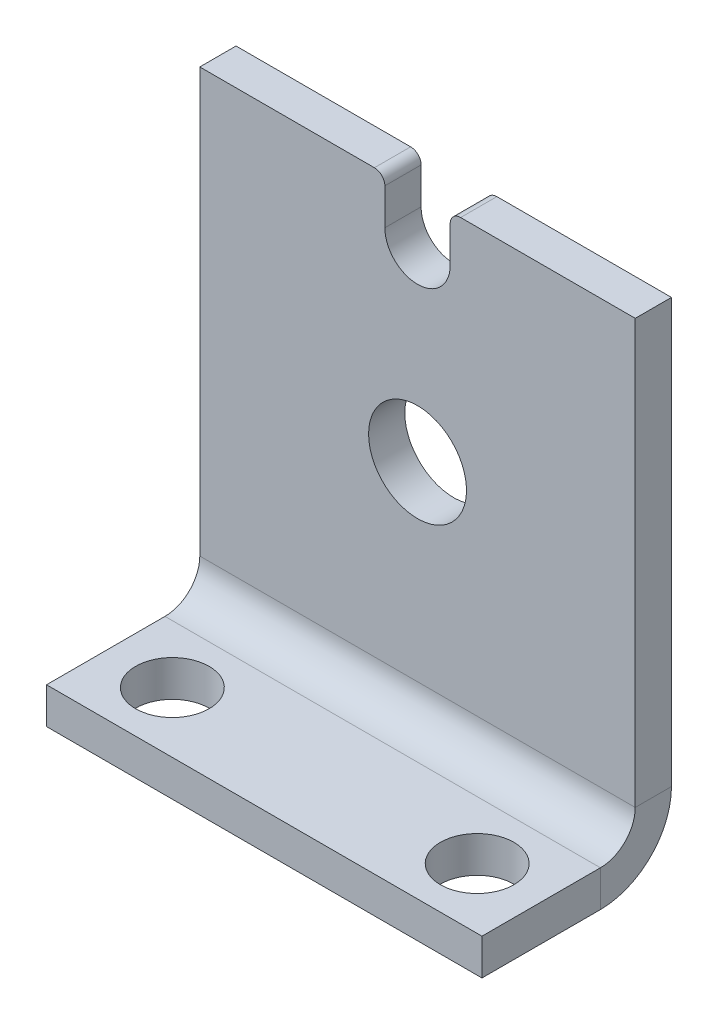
ISO-10303-21;
HEADER;
FILE_DESCRIPTION(('STEP AP214'),'2;1');
FILE_NAME('part.step','',(''),(''),'','','');
FILE_SCHEMA(('AUTOMOTIVE_DESIGN { 1 0 10303 214 1 1 1 1 }'));
ENDSEC;
DATA;
#1=APPLICATION_CONTEXT('core data for automotive mechanical design processes');
#2=APPLICATION_PROTOCOL_DEFINITION('international standard','automotive_design',2000,#1);
#3=PRODUCT_CONTEXT('',#1,'mechanical');
#4=PRODUCT('Part','Part','',(#3));
#5=PRODUCT_RELATED_PRODUCT_CATEGORY('part','',(#4));
#6=PRODUCT_DEFINITION_FORMATION('','',#4);
#7=PRODUCT_DEFINITION_CONTEXT('part definition',#1,'design');
#8=PRODUCT_DEFINITION('design','',#6,#7);
#9=PRODUCT_DEFINITION_SHAPE('','',#8);
#10=(LENGTH_UNIT() NAMED_UNIT(*) SI_UNIT(.MILLI.,.METRE.));
#11=(NAMED_UNIT(*) PLANE_ANGLE_UNIT() SI_UNIT($,.RADIAN.));
#12=(NAMED_UNIT(*) SI_UNIT($,.STERADIAN.) SOLID_ANGLE_UNIT());
#13=UNCERTAINTY_MEASURE_WITH_UNIT(LENGTH_MEASURE(1.E-05),#10,'distance_accuracy_value','');
#14=(GEOMETRIC_REPRESENTATION_CONTEXT(3) GLOBAL_UNCERTAINTY_ASSIGNED_CONTEXT((#13)) GLOBAL_UNIT_ASSIGNED_CONTEXT((#10,
#11,#12)) REPRESENTATION_CONTEXT('',''));
#15=CARTESIAN_POINT('',(0.,0.,0.));
#16=DIRECTION('',(0.,0.,1.));
#17=DIRECTION('',(1.,0.,0.));
#18=AXIS2_PLACEMENT_3D('',#15,#16,#17);
#19=CARTESIAN_POINT('',(-15.875,18.034,-2.6416));
#20=DIRECTION('',(0.,1.,0.));
#21=DIRECTION('',(0.,0.,1.));
#22=AXIS2_PLACEMENT_3D('',#19,#20,#21);
#23=PLANE('',#22);
#24=DIRECTION('',(-1.,0.,0.));
#25=VECTOR('',#24,1.);
#26=CARTESIAN_POINT('',(-15.875,18.034,0.));
#27=LINE('',#26,#25);
#28=CARTESIAN_POINT('',(-3.14325,18.034,0.));
#29=VERTEX_POINT('',#28);
#30=CARTESIAN_POINT('',(-15.875,18.034,0.));
#31=VERTEX_POINT('',#30);
#32=EDGE_CURVE('E273',#29,#31,#27,.T.);
#33=ORIENTED_EDGE('',*,*,#32,.F.);
#34=DIRECTION('',(0.,0.,1.));
#35=VECTOR('',#34,1.);
#36=CARTESIAN_POINT('',(-3.14325,18.034,-2.6416));
#37=LINE('',#36,#35);
#38=CARTESIAN_POINT('',(-3.14325,18.034,-2.6416));
#39=VERTEX_POINT('',#38);
#40=EDGE_CURVE('E289',#29,#39,#37,.F.);
#41=ORIENTED_EDGE('',*,*,#40,.T.);
#42=DIRECTION('',(-1.,0.,0.));
#43=VECTOR('',#42,1.);
#44=CARTESIAN_POINT('',(-15.875,18.034,-2.6416));
#45=LINE('',#44,#43);
#46=CARTESIAN_POINT('',(-15.875,18.034,-2.6416));
#47=VERTEX_POINT('',#46);
#48=EDGE_CURVE('E264',#39,#47,#45,.T.);
#49=ORIENTED_EDGE('',*,*,#48,.T.);
#50=DIRECTION('',(0.,0.,1.));
#51=VECTOR('',#50,1.);
#52=CARTESIAN_POINT('',(-15.875,18.034,-2.6416));
#53=LINE('',#52,#51);
#54=EDGE_CURVE('E278',#47,#31,#53,.T.);
#55=ORIENTED_EDGE('',*,*,#54,.T.);
#56=EDGE_LOOP('',(#33,#41,#49,#55));
#57=FACE_BOUND('',#56,.T.);
#58=ADVANCED_FACE('F56',(#57),#23,.T.);
#59=CARTESIAN_POINT('',(15.875,-18.034,-2.6416));
#60=DIRECTION('',(1.,0.,0.));
#61=DIRECTION('',(0.,0.,-1.));
#62=AXIS2_PLACEMENT_3D('',#59,#60,#61);
#63=PLANE('',#62);
#64=DIRECTION('',(0.,1.,0.));
#65=VECTOR('',#64,1.);
#66=CARTESIAN_POINT('',(15.875,-18.034,0.));
#67=LINE('',#66,#65);
#68=CARTESIAN_POINT('',(15.875,-12.8524,0.));
#69=VERTEX_POINT('',#68);
#70=CARTESIAN_POINT('',(15.875,18.034,0.));
#71=VERTEX_POINT('',#70);
#72=EDGE_CURVE('E259',#69,#71,#67,.T.);
#73=ORIENTED_EDGE('',*,*,#72,.F.);
#74=DIRECTION('',(0.,0.,-1.));
#75=VECTOR('',#74,1.);
#76=CARTESIAN_POINT('',(15.875,-12.8524,0.));
#77=LINE('',#76,#75);
#78=CARTESIAN_POINT('',(15.875,-12.8524,-2.6416));
#79=VERTEX_POINT('',#78);
#80=EDGE_CURVE('E246',#69,#79,#77,.T.);
#81=ORIENTED_EDGE('',*,*,#80,.T.);
#82=DIRECTION('',(0.,1.,0.));
#83=VECTOR('',#82,1.);
#84=CARTESIAN_POINT('',(15.875,-18.034,-2.6416));
#85=LINE('',#84,#83);
#86=CARTESIAN_POINT('',(15.875,18.034,-2.6416));
#87=VERTEX_POINT('',#86);
#88=EDGE_CURVE('E262',#79,#87,#85,.T.);
#89=ORIENTED_EDGE('',*,*,#88,.T.);
#90=DIRECTION('',(0.,0.,1.));
#91=VECTOR('',#90,1.);
#92=CARTESIAN_POINT('',(15.875,18.034,-2.6416));
#93=LINE('',#92,#91);
#94=EDGE_CURVE('E271',#87,#71,#93,.T.);
#95=ORIENTED_EDGE('',*,*,#94,.T.);
#96=EDGE_LOOP('',(#73,#81,#89,#95));
#97=FACE_BOUND('',#96,.T.);
#98=ADVANCED_FACE('F317',(#97),#63,.T.);
#99=CARTESIAN_POINT('',(0.,0.,-2.6416));
#100=DIRECTION('',(0.,0.,-1.));
#101=DIRECTION('',(-1.,0.,0.));
#102=AXIS2_PLACEMENT_3D('',#99,#100,#101);
#103=PLANE('',#102);
#104=ORIENTED_EDGE('',*,*,#48,.F.);
#105=CARTESIAN_POINT('',(-3.14325,17.272,-2.6416));
#106=DIRECTION('',(0.,0.,-1.));
#107=DIRECTION('',(-1.,0.,0.));
#108=AXIS2_PLACEMENT_3D('',#105,#106,#107);
#109=CIRCLE('',#108,0.762);
#110=CARTESIAN_POINT('',(-2.38125,17.272,-2.6416));
#111=VERTEX_POINT('',#110);
#112=EDGE_CURVE('E292',#39,#111,#109,.T.);
#113=ORIENTED_EDGE('',*,*,#112,.T.);
#114=DIRECTION('',(0.,1.,0.));
#115=VECTOR('',#114,1.);
#116=CARTESIAN_POINT('',(-2.38125,20.4917479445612,-2.6416));
#117=LINE('',#116,#115);
#118=CARTESIAN_POINT('',(-2.38125,14.62405,-2.6416));
#119=VERTEX_POINT('',#118);
#120=EDGE_CURVE('E167',#119,#111,#117,.T.);
#121=ORIENTED_EDGE('',*,*,#120,.F.);
#122=CARTESIAN_POINT('',(0.,14.62405,-2.6416));
#123=DIRECTION('',(0.,0.,-1.));
#124=DIRECTION('',(-1.,0.,0.));
#125=AXIS2_PLACEMENT_3D('',#122,#123,#124);
#126=CIRCLE('',#125,2.38125);
#127=CARTESIAN_POINT('',(2.38125,14.62405,-2.6416));
#128=VERTEX_POINT('',#127);
#129=EDGE_CURVE('E185',#128,#119,#126,.T.);
#130=ORIENTED_EDGE('',*,*,#129,.F.);
#131=DIRECTION('',(0.,-1.,0.));
#132=VECTOR('',#131,1.);
#133=CARTESIAN_POINT('',(2.38125,20.4917479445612,-2.6416));
#134=LINE('',#133,#132);
#135=CARTESIAN_POINT('',(2.38125,17.272,-2.6416));
#136=VERTEX_POINT('',#135);
#137=EDGE_CURVE('E172',#136,#128,#134,.T.);
#138=ORIENTED_EDGE('',*,*,#137,.F.);
#139=CARTESIAN_POINT('',(3.14325,17.272,-2.6416));
#140=DIRECTION('',(0.,0.,-1.));
#141=DIRECTION('',(-1.,0.,0.));
#142=AXIS2_PLACEMENT_3D('',#139,#140,#141);
#143=CIRCLE('',#142,0.762);
#144=CARTESIAN_POINT('',(3.14325,18.034,-2.6416));
#145=VERTEX_POINT('',#144);
#146=EDGE_CURVE('E71',#136,#145,#143,.T.);
#147=ORIENTED_EDGE('',*,*,#146,.T.);
#148=EDGE_CURVE('E266',#87,#145,#45,.T.);
#149=ORIENTED_EDGE('',*,*,#148,.F.);
#150=ORIENTED_EDGE('',*,*,#88,.F.);
#151=DIRECTION('',(1.,0.,0.));
#152=VECTOR('',#151,1.);
#153=CARTESIAN_POINT('',(15.875,-12.8524,-2.6416));
#154=LINE('',#153,#152);
#155=CARTESIAN_POINT('',(-15.875,-12.8524,-2.6416));
#156=VERTEX_POINT('',#155);
#157=EDGE_CURVE('E239',#79,#156,#154,.F.);
#158=ORIENTED_EDGE('',*,*,#157,.T.);
#159=DIRECTION('',(0.,-1.,0.));
#160=VECTOR('',#159,1.);
#161=CARTESIAN_POINT('',(-15.875,-18.034,-2.6416));
#162=LINE('',#161,#160);
#163=EDGE_CURVE('E268',#47,#156,#162,.T.);
#164=ORIENTED_EDGE('',*,*,#163,.F.);
#165=EDGE_LOOP('',(#104,#113,#121,#130,#138,#147,#149,#150,#158,#164));
#166=FACE_BOUND('',#165,.T.);
#167=CARTESIAN_POINT('',(0.,1.01599999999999,-2.6416));
#168=DIRECTION('',(0.,0.,-1.));
#169=DIRECTION('',(-1.,0.,0.));
#170=AXIS2_PLACEMENT_3D('',#167,#168,#169);
#171=CIRCLE('',#170,3.5687);
#172=CARTESIAN_POINT('',(-3.5687,1.01599999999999,-2.6416));
#173=VERTEX_POINT('',#172);
#174=EDGE_CURVE('E189',#173,#173,#171,.T.);
#175=ORIENTED_EDGE('',*,*,#174,.F.);
#176=EDGE_LOOP('',(#175));
#177=FACE_BOUND('',#176,.T.);
#178=ADVANCED_FACE('F294',(#166,#177),#103,.T.);
#179=CARTESIAN_POINT('',(0.,0.,0.));
#180=DIRECTION('',(0.,0.,-1.));
#181=DIRECTION('',(-1.,0.,0.));
#182=AXIS2_PLACEMENT_3D('',#179,#180,#181);
#183=PLANE('',#182);
#184=CARTESIAN_POINT('',(0.,1.01599999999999,0.));
#185=DIRECTION('',(0.,0.,-1.));
#186=DIRECTION('',(-1.,0.,0.));
#187=AXIS2_PLACEMENT_3D('',#184,#185,#186);
#188=CIRCLE('',#187,3.5687);
#189=CARTESIAN_POINT('',(-3.5687,1.01599999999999,0.));
#190=VERTEX_POINT('',#189);
#191=EDGE_CURVE('E191',#190,#190,#188,.T.);
#192=ORIENTED_EDGE('',*,*,#191,.T.);
#193=EDGE_LOOP('',(#192));
#194=FACE_BOUND('',#193,.T.);
#195=DIRECTION('',(0.,1.,0.));
#196=VECTOR('',#195,1.);
#197=CARTESIAN_POINT('',(-2.38125,20.4917479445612,0.));
#198=LINE('',#197,#196);
#199=CARTESIAN_POINT('',(-2.38125,14.62405,0.));
#200=VERTEX_POINT('',#199);
#201=CARTESIAN_POINT('',(-2.38125,17.272,0.));
#202=VERTEX_POINT('',#201);
#203=EDGE_CURVE('E177',#200,#202,#198,.T.);
#204=ORIENTED_EDGE('',*,*,#203,.T.);
#205=CARTESIAN_POINT('',(-3.14325,17.272,0.));
#206=DIRECTION('',(0.,0.,-1.));
#207=DIRECTION('',(-1.,0.,0.));
#208=AXIS2_PLACEMENT_3D('',#205,#206,#207);
#209=CIRCLE('',#208,0.762);
#210=EDGE_CURVE('E287',#202,#29,#209,.F.);
#211=ORIENTED_EDGE('',*,*,#210,.T.);
#212=ORIENTED_EDGE('',*,*,#32,.T.);
#213=DIRECTION('',(0.,-1.,0.));
#214=VECTOR('',#213,1.);
#215=CARTESIAN_POINT('',(-15.875,-18.034,0.));
#216=LINE('',#215,#214);
#217=CARTESIAN_POINT('',(-15.875,-12.8524,0.));
#218=VERTEX_POINT('',#217);
#219=EDGE_CURVE('E265',#31,#218,#216,.T.);
#220=ORIENTED_EDGE('',*,*,#219,.T.);
#221=DIRECTION('',(1.,0.,0.));
#222=VECTOR('',#221,1.);
#223=CARTESIAN_POINT('',(15.875,-12.8524,0.));
#224=LINE('',#223,#222);
#225=EDGE_CURVE('E252',#69,#218,#224,.F.);
#226=ORIENTED_EDGE('',*,*,#225,.F.);
#227=ORIENTED_EDGE('',*,*,#72,.T.);
#228=CARTESIAN_POINT('',(3.14325,18.034,0.));
#229=VERTEX_POINT('',#228);
#230=EDGE_CURVE('E274',#71,#229,#27,.T.);
#231=ORIENTED_EDGE('',*,*,#230,.T.);
#232=CARTESIAN_POINT('',(3.14325,17.272,0.));
#233=DIRECTION('',(0.,0.,-1.));
#234=DIRECTION('',(-1.,0.,0.));
#235=AXIS2_PLACEMENT_3D('',#232,#233,#234);
#236=CIRCLE('',#235,0.762);
#237=CARTESIAN_POINT('',(2.38125,17.272,0.));
#238=VERTEX_POINT('',#237);
#239=EDGE_CURVE('E165',#229,#238,#236,.F.);
#240=ORIENTED_EDGE('',*,*,#239,.T.);
#241=DIRECTION('',(0.,-1.,0.));
#242=VECTOR('',#241,1.);
#243=CARTESIAN_POINT('',(2.38125,20.4917479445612,0.));
#244=LINE('',#243,#242);
#245=CARTESIAN_POINT('',(2.38125,14.62405,0.));
#246=VERTEX_POINT('',#245);
#247=EDGE_CURVE('E157',#238,#246,#244,.T.);
#248=ORIENTED_EDGE('',*,*,#247,.T.);
#249=CARTESIAN_POINT('',(0.,14.62405,0.));
#250=DIRECTION('',(0.,0.,-1.));
#251=DIRECTION('',(-1.,0.,0.));
#252=AXIS2_PLACEMENT_3D('',#249,#250,#251);
#253=CIRCLE('',#252,2.38125);
#254=EDGE_CURVE('E162',#246,#200,#253,.T.);
#255=ORIENTED_EDGE('',*,*,#254,.T.);
#256=EDGE_LOOP('',(#204,#211,#212,#220,#226,#227,#231,#240,#248,#255));
#257=FACE_BOUND('',#256,.T.);
#258=ADVANCED_FACE('F160',(#194,#257),#183,.F.);
#259=CARTESIAN_POINT('',(-15.875,-18.034,-2.6416));
#260=DIRECTION('',(-1.,0.,0.));
#261=DIRECTION('',(0.,0.,1.));
#262=AXIS2_PLACEMENT_3D('',#259,#260,#261);
#263=PLANE('',#262);
#264=DIRECTION('',(0.,0.,-1.));
#265=VECTOR('',#264,1.);
#266=CARTESIAN_POINT('',(-15.875,-12.8524,0.));
#267=LINE('',#266,#265);
#268=EDGE_CURVE('E256',#218,#156,#267,.T.);
#269=ORIENTED_EDGE('',*,*,#268,.F.);
#270=ORIENTED_EDGE('',*,*,#219,.F.);
#271=ORIENTED_EDGE('',*,*,#54,.F.);
#272=ORIENTED_EDGE('',*,*,#163,.T.);
#273=EDGE_LOOP('',(#269,#270,#271,#272));
#274=FACE_BOUND('',#273,.T.);
#275=ADVANCED_FACE('F311',(#274),#263,.T.);
#276=ORIENTED_EDGE('',*,*,#148,.T.);
#277=DIRECTION('',(0.,0.,-1.));
#278=VECTOR('',#277,1.);
#279=CARTESIAN_POINT('',(3.14325,18.034,0.));
#280=LINE('',#279,#278);
#281=EDGE_CURVE('E13',#145,#229,#280,.F.);
#282=ORIENTED_EDGE('',*,*,#281,.T.);
#283=ORIENTED_EDGE('',*,*,#230,.F.);
#284=ORIENTED_EDGE('',*,*,#94,.F.);
#285=EDGE_LOOP('',(#276,#282,#283,#284));
#286=FACE_BOUND('',#285,.T.);
#287=ADVANCED_FACE('F322',(#286),#23,.T.);
#288=CARTESIAN_POINT('',(-15.875,-12.8524,2.54));
#289=DIRECTION('',(-1.,0.,0.));
#290=DIRECTION('',(0.,0.,1.));
#291=AXIS2_PLACEMENT_3D('',#288,#289,#290);
#292=PLANE('',#291);
#293=DIRECTION('',(0.,1.,0.));
#294=VECTOR('',#293,1.);
#295=CARTESIAN_POINT('',(-15.875,-18.034,2.53999999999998));
#296=LINE('',#295,#294);
#297=CARTESIAN_POINT('',(-15.875,-15.3924,2.53999999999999));
#298=VERTEX_POINT('',#297);
#299=CARTESIAN_POINT('',(-15.875,-18.034,2.53999999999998));
#300=VERTEX_POINT('',#299);
#301=EDGE_CURVE('E206',#298,#300,#296,.F.);
#302=ORIENTED_EDGE('',*,*,#301,.F.);
#303=CARTESIAN_POINT('',(-15.875,-12.8524,2.54));
#304=DIRECTION('',(1.,0.,0.));
#305=DIRECTION('',(0.,0.,-1.));
#306=AXIS2_PLACEMENT_3D('',#303,#304,#305);
#307=CIRCLE('',#306,2.54);
#308=EDGE_CURVE('E249',#218,#298,#307,.F.);
#309=ORIENTED_EDGE('',*,*,#308,.F.);
#310=ORIENTED_EDGE('',*,*,#268,.T.);
#311=CARTESIAN_POINT('',(-15.875,-12.8524,2.54));
#312=DIRECTION('',(1.,0.,0.));
#313=DIRECTION('',(0.,0.,-1.));
#314=AXIS2_PLACEMENT_3D('',#311,#312,#313);
#315=CIRCLE('',#314,5.1816);
#316=EDGE_CURVE('E242',#156,#300,#315,.F.);
#317=ORIENTED_EDGE('',*,*,#316,.T.);
#318=EDGE_LOOP('',(#302,#309,#310,#317));
#319=FACE_BOUND('',#318,.T.);
#320=ADVANCED_FACE('F337',(#319),#292,.T.);
#321=CARTESIAN_POINT('',(15.875,-12.8524,2.54));
#322=DIRECTION('',(-1.,0.,0.));
#323=DIRECTION('',(0.,0.,1.));
#324=AXIS2_PLACEMENT_3D('',#321,#322,#323);
#325=PLANE('',#324);
#326=CARTESIAN_POINT('',(15.875,-12.8524,2.54));
#327=DIRECTION('',(1.,0.,0.));
#328=DIRECTION('',(0.,0.,-1.));
#329=AXIS2_PLACEMENT_3D('',#326,#327,#328);
#330=CIRCLE('',#329,2.54);
#331=CARTESIAN_POINT('',(15.875,-15.3924,2.53999999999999));
#332=VERTEX_POINT('',#331);
#333=EDGE_CURVE('E212',#332,#69,#330,.T.);
#334=ORIENTED_EDGE('',*,*,#333,.F.);
#335=DIRECTION('',(0.,1.,0.));
#336=VECTOR('',#335,1.);
#337=CARTESIAN_POINT('',(15.875,-15.3924,2.53999999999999));
#338=LINE('',#337,#336);
#339=CARTESIAN_POINT('',(15.875,-18.034,2.53999999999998));
#340=VERTEX_POINT('',#339);
#341=EDGE_CURVE('E232',#332,#340,#338,.F.);
#342=ORIENTED_EDGE('',*,*,#341,.T.);
#343=CARTESIAN_POINT('',(15.875,-12.8524,2.54));
#344=DIRECTION('',(1.,0.,0.));
#345=DIRECTION('',(0.,0.,-1.));
#346=AXIS2_PLACEMENT_3D('',#343,#344,#345);
#347=CIRCLE('',#346,5.1816);
#348=EDGE_CURVE('E243',#340,#79,#347,.T.);
#349=ORIENTED_EDGE('',*,*,#348,.T.);
#350=ORIENTED_EDGE('',*,*,#80,.F.);
#351=EDGE_LOOP('',(#334,#342,#349,#350));
#352=FACE_BOUND('',#351,.T.);
#353=ADVANCED_FACE('F343',(#352),#325,.F.);
#354=CARTESIAN_POINT('',(15.875,-12.8524,2.54));
#355=DIRECTION('',(1.,0.,0.));
#356=DIRECTION('',(0.,-1.,0.));
#357=AXIS2_PLACEMENT_3D('',#354,#355,#356);
#358=CYLINDRICAL_SURFACE('',#357,5.1816);
#359=ORIENTED_EDGE('',*,*,#157,.F.);
#360=ORIENTED_EDGE('',*,*,#348,.F.);
#361=DIRECTION('',(1.,0.,0.));
#362=VECTOR('',#361,1.);
#363=CARTESIAN_POINT('',(-15.875,-18.034,2.53999999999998));
#364=LINE('',#363,#362);
#365=EDGE_CURVE('E230',#340,#300,#364,.F.);
#366=ORIENTED_EDGE('',*,*,#365,.T.);
#367=ORIENTED_EDGE('',*,*,#316,.F.);
#368=EDGE_LOOP('',(#359,#360,#366,#367));
#369=FACE_BOUND('',#368,.T.);
#370=ADVANCED_FACE('F355',(#369),#358,.T.);
#371=CARTESIAN_POINT('',(15.875,-12.8524,2.54));
#372=DIRECTION('',(1.,0.,0.));
#373=DIRECTION('',(0.,-1.,0.));
#374=AXIS2_PLACEMENT_3D('',#371,#372,#373);
#375=CYLINDRICAL_SURFACE('',#374,2.54);
#376=ORIENTED_EDGE('',*,*,#225,.T.);
#377=ORIENTED_EDGE('',*,*,#308,.T.);
#378=DIRECTION('',(1.,0.,0.));
#379=VECTOR('',#378,1.);
#380=CARTESIAN_POINT('',(-15.875,-15.3924,2.53999999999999));
#381=LINE('',#380,#379);
#382=EDGE_CURVE('E235',#298,#332,#381,.T.);
#383=ORIENTED_EDGE('',*,*,#382,.T.);
#384=ORIENTED_EDGE('',*,*,#333,.T.);
#385=EDGE_LOOP('',(#376,#377,#383,#384));
#386=FACE_BOUND('',#385,.T.);
#387=ADVANCED_FACE('F358',(#386),#375,.F.);
#388=CARTESIAN_POINT('',(15.875,-18.034,11.176));
#389=DIRECTION('',(-1.,0.,0.));
#390=DIRECTION('',(0.,0.,1.));
#391=AXIS2_PLACEMENT_3D('',#388,#389,#390);
#392=PLANE('',#391);
#393=ORIENTED_EDGE('',*,*,#341,.F.);
#394=DIRECTION('',(0.,0.,-1.));
#395=VECTOR('',#394,1.);
#396=CARTESIAN_POINT('',(15.875,-15.3924,11.176));
#397=LINE('',#396,#395);
#398=CARTESIAN_POINT('',(15.875,-15.3924,11.176));
#399=VERTEX_POINT('',#398);
#400=EDGE_CURVE('E228',#332,#399,#397,.F.);
#401=ORIENTED_EDGE('',*,*,#400,.T.);
#402=DIRECTION('',(0.,1.,0.));
#403=VECTOR('',#402,1.);
#404=CARTESIAN_POINT('',(15.875,-18.034,11.176));
#405=LINE('',#404,#403);
#406=CARTESIAN_POINT('',(15.875,-18.034,11.176));
#407=VERTEX_POINT('',#406);
#408=EDGE_CURVE('E209',#407,#399,#405,.T.);
#409=ORIENTED_EDGE('',*,*,#408,.F.);
#410=DIRECTION('',(0.,0.,1.));
#411=VECTOR('',#410,1.);
#412=CARTESIAN_POINT('',(15.875,-18.034,0.));
#413=LINE('',#412,#411);
#414=EDGE_CURVE('E221',#340,#407,#413,.T.);
#415=ORIENTED_EDGE('',*,*,#414,.F.);
#416=EDGE_LOOP('',(#393,#401,#409,#415));
#417=FACE_BOUND('',#416,.T.);
#418=ADVANCED_FACE('F361',(#417),#392,.F.);
#419=CARTESIAN_POINT('',(-15.875,-18.034,0.));
#420=DIRECTION('',(1.,0.,0.));
#421=DIRECTION('',(0.,0.,-1.));
#422=AXIS2_PLACEMENT_3D('',#419,#420,#421);
#423=PLANE('',#422);
#424=ORIENTED_EDGE('',*,*,#301,.T.);
#425=DIRECTION('',(0.,0.,-1.));
#426=VECTOR('',#425,1.);
#427=CARTESIAN_POINT('',(-15.875,-18.034,0.));
#428=LINE('',#427,#426);
#429=CARTESIAN_POINT('',(-15.875,-18.034,11.176));
#430=VERTEX_POINT('',#429);
#431=EDGE_CURVE('E216',#430,#300,#428,.T.);
#432=ORIENTED_EDGE('',*,*,#431,.F.);
#433=DIRECTION('',(0.,1.,0.));
#434=VECTOR('',#433,1.);
#435=CARTESIAN_POINT('',(-15.875,-18.034,11.176));
#436=LINE('',#435,#434);
#437=CARTESIAN_POINT('',(-15.875,-15.3924,11.176));
#438=VERTEX_POINT('',#437);
#439=EDGE_CURVE('E213',#430,#438,#436,.T.);
#440=ORIENTED_EDGE('',*,*,#439,.T.);
#441=DIRECTION('',(0.,0.,1.));
#442=VECTOR('',#441,1.);
#443=CARTESIAN_POINT('',(-15.875,-15.3924,0.));
#444=LINE('',#443,#442);
#445=EDGE_CURVE('E223',#438,#298,#444,.F.);
#446=ORIENTED_EDGE('',*,*,#445,.T.);
#447=EDGE_LOOP('',(#424,#432,#440,#446));
#448=FACE_BOUND('',#447,.T.);
#449=ADVANCED_FACE('F367',(#448),#423,.F.);
#450=CARTESIAN_POINT('',(0.,-18.034,0.));
#451=DIRECTION('',(0.,1.,0.));
#452=DIRECTION('',(0.,0.,1.));
#453=AXIS2_PLACEMENT_3D('',#450,#451,#452);
#454=PLANE('',#453);
#455=CARTESIAN_POINT('',(-11.1125,-18.034,6.76376257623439));
#456=DIRECTION('',(0.,-1.,0.));
#457=DIRECTION('',(0.,0.,-1.));
#458=AXIS2_PLACEMENT_3D('',#455,#456,#457);
#459=CIRCLE('',#458,2.6797);
#460=CARTESIAN_POINT('',(-11.1125,-18.034,4.08406257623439));
#461=VERTEX_POINT('',#460);
#462=EDGE_CURVE('E194',#461,#461,#459,.T.);
#463=ORIENTED_EDGE('',*,*,#462,.F.);
#464=EDGE_LOOP('',(#463));
#465=FACE_BOUND('',#464,.T.);
#466=CARTESIAN_POINT('',(11.1125,-18.034,6.76376257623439));
#467=DIRECTION('',(0.,-1.,0.));
#468=DIRECTION('',(0.,0.,-1.));
#469=AXIS2_PLACEMENT_3D('',#466,#467,#468);
#470=CIRCLE('',#469,2.6797);
#471=CARTESIAN_POINT('',(11.1125,-18.034,4.08406257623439));
#472=VERTEX_POINT('',#471);
#473=EDGE_CURVE('E200',#472,#472,#470,.T.);
#474=ORIENTED_EDGE('',*,*,#473,.F.);
#475=EDGE_LOOP('',(#474));
#476=FACE_BOUND('',#475,.T.);
#477=ORIENTED_EDGE('',*,*,#365,.F.);
#478=ORIENTED_EDGE('',*,*,#414,.T.);
#479=DIRECTION('',(-1.,0.,0.));
#480=VECTOR('',#479,1.);
#481=CARTESIAN_POINT('',(0.,-18.034,11.176));
#482=LINE('',#481,#480);
#483=EDGE_CURVE('E219',#407,#430,#482,.T.);
#484=ORIENTED_EDGE('',*,*,#483,.T.);
#485=ORIENTED_EDGE('',*,*,#431,.T.);
#486=EDGE_LOOP('',(#477,#478,#484,#485));
#487=FACE_BOUND('',#486,.T.);
#488=ADVANCED_FACE('F377',(#465,#476,#487),#454,.F.);
#489=CARTESIAN_POINT('',(0.,-15.3924,0.));
#490=DIRECTION('',(0.,1.,0.));
#491=DIRECTION('',(0.,0.,1.));
#492=AXIS2_PLACEMENT_3D('',#489,#490,#491);
#493=PLANE('',#492);
#494=CARTESIAN_POINT('',(-11.1125,-15.3924,6.7637625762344));
#495=DIRECTION('',(0.,-1.,0.));
#496=DIRECTION('',(0.,0.,-1.));
#497=AXIS2_PLACEMENT_3D('',#494,#495,#496);
#498=CIRCLE('',#497,2.6797);
#499=CARTESIAN_POINT('',(-11.1125,-15.3924,4.0840625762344));
#500=VERTEX_POINT('',#499);
#501=EDGE_CURVE('E197',#500,#500,#498,.T.);
#502=ORIENTED_EDGE('',*,*,#501,.T.);
#503=EDGE_LOOP('',(#502));
#504=FACE_BOUND('',#503,.T.);
#505=CARTESIAN_POINT('',(11.1125,-15.3924,6.7637625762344));
#506=DIRECTION('',(0.,-1.,0.));
#507=DIRECTION('',(0.,0.,-1.));
#508=AXIS2_PLACEMENT_3D('',#505,#506,#507);
#509=CIRCLE('',#508,2.6797);
#510=CARTESIAN_POINT('',(11.1125,-15.3924,4.0840625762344));
#511=VERTEX_POINT('',#510);
#512=EDGE_CURVE('E203',#511,#511,#509,.T.);
#513=ORIENTED_EDGE('',*,*,#512,.T.);
#514=EDGE_LOOP('',(#513));
#515=FACE_BOUND('',#514,.T.);
#516=ORIENTED_EDGE('',*,*,#400,.F.);
#517=ORIENTED_EDGE('',*,*,#382,.F.);
#518=ORIENTED_EDGE('',*,*,#445,.F.);
#519=DIRECTION('',(1.,0.,0.));
#520=VECTOR('',#519,1.);
#521=CARTESIAN_POINT('',(-15.875,-15.3924,11.176));
#522=LINE('',#521,#520);
#523=EDGE_CURVE('E226',#399,#438,#522,.F.);
#524=ORIENTED_EDGE('',*,*,#523,.F.);
#525=EDGE_LOOP('',(#516,#517,#518,#524));
#526=FACE_BOUND('',#525,.T.);
#527=ADVANCED_FACE('F373',(#504,#515,#526),#493,.T.);
#528=CARTESIAN_POINT('',(-15.875,-18.034,11.176));
#529=DIRECTION('',(0.,0.,-1.));
#530=DIRECTION('',(0.,1.,0.));
#531=AXIS2_PLACEMENT_3D('',#528,#529,#530);
#532=PLANE('',#531);
#533=ORIENTED_EDGE('',*,*,#523,.T.);
#534=ORIENTED_EDGE('',*,*,#439,.F.);
#535=ORIENTED_EDGE('',*,*,#483,.F.);
#536=ORIENTED_EDGE('',*,*,#408,.T.);
#537=EDGE_LOOP('',(#533,#534,#535,#536));
#538=FACE_BOUND('',#537,.T.);
#539=ADVANCED_FACE('F369',(#538),#532,.F.);
#540=CARTESIAN_POINT('',(11.1125,-15.3924,6.7637625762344));
#541=DIRECTION('',(0.,-1.,0.));
#542=DIRECTION('',(0.,0.,-1.));
#543=AXIS2_PLACEMENT_3D('',#540,#541,#542);
#544=CYLINDRICAL_SURFACE('',#543,2.6797);
#545=ORIENTED_EDGE('',*,*,#512,.F.);
#546=EDGE_LOOP('',(#545));
#547=FACE_BOUND('',#546,.T.);
#548=ORIENTED_EDGE('',*,*,#473,.T.);
#549=EDGE_LOOP('',(#548));
#550=FACE_BOUND('',#549,.T.);
#551=ADVANCED_FACE('F372',(#547,#550),#544,.F.);
#552=CARTESIAN_POINT('',(-11.1125,-15.3924,6.7637625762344));
#553=DIRECTION('',(0.,-1.,0.));
#554=DIRECTION('',(0.,0.,-1.));
#555=AXIS2_PLACEMENT_3D('',#552,#553,#554);
#556=CYLINDRICAL_SURFACE('',#555,2.6797);
#557=ORIENTED_EDGE('',*,*,#501,.F.);
#558=EDGE_LOOP('',(#557));
#559=FACE_BOUND('',#558,.T.);
#560=ORIENTED_EDGE('',*,*,#462,.T.);
#561=EDGE_LOOP('',(#560));
#562=FACE_BOUND('',#561,.T.);
#563=ADVANCED_FACE('F387',(#559,#562),#556,.F.);
#564=CARTESIAN_POINT('',(0.,1.01599999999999,0.));
#565=DIRECTION('',(0.,0.,-1.));
#566=DIRECTION('',(-1.,0.,0.));
#567=AXIS2_PLACEMENT_3D('',#564,#565,#566);
#568=CYLINDRICAL_SURFACE('',#567,3.5687);
#569=ORIENTED_EDGE('',*,*,#191,.F.);
#570=EDGE_LOOP('',(#569));
#571=FACE_BOUND('',#570,.T.);
#572=ORIENTED_EDGE('',*,*,#174,.T.);
#573=EDGE_LOOP('',(#572));
#574=FACE_BOUND('',#573,.T.);
#575=ADVANCED_FACE('F391',(#571,#574),#568,.F.);
#576=CARTESIAN_POINT('',(-2.38125,20.4917479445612,0.));
#577=DIRECTION('',(-1.,0.,0.));
#578=DIRECTION('',(0.,-1.,0.));
#579=AXIS2_PLACEMENT_3D('',#576,#577,#578);
#580=PLANE('',#579);
#581=ORIENTED_EDGE('',*,*,#120,.T.);
#582=DIRECTION('',(0.,0.,1.));
#583=VECTOR('',#582,1.);
#584=CARTESIAN_POINT('',(-2.38125,17.272,0.));
#585=LINE('',#584,#583);
#586=EDGE_CURVE('E281',#111,#202,#585,.T.);
#587=ORIENTED_EDGE('',*,*,#586,.T.);
#588=ORIENTED_EDGE('',*,*,#203,.F.);
#589=DIRECTION('',(0.,0.,-1.));
#590=VECTOR('',#589,1.);
#591=CARTESIAN_POINT('',(-2.38125,14.62405,0.));
#592=LINE('',#591,#590);
#593=EDGE_CURVE('E176',#200,#119,#592,.T.);
#594=ORIENTED_EDGE('',*,*,#593,.T.);
#595=EDGE_LOOP('',(#581,#587,#588,#594));
#596=FACE_BOUND('',#595,.T.);
#597=ADVANCED_FACE('F300',(#596),#580,.F.);
#598=CARTESIAN_POINT('',(0.,14.62405,0.));
#599=DIRECTION('',(0.,0.,-1.));
#600=DIRECTION('',(-1.,0.,0.));
#601=AXIS2_PLACEMENT_3D('',#598,#599,#600);
#602=CYLINDRICAL_SURFACE('',#601,2.38125);
#603=ORIENTED_EDGE('',*,*,#129,.T.);
#604=ORIENTED_EDGE('',*,*,#593,.F.);
#605=ORIENTED_EDGE('',*,*,#254,.F.);
#606=DIRECTION('',(0.,0.,-1.));
#607=VECTOR('',#606,1.);
#608=CARTESIAN_POINT('',(2.38125,14.62405,0.));
#609=LINE('',#608,#607);
#610=EDGE_CURVE('E170',#246,#128,#609,.T.);
#611=ORIENTED_EDGE('',*,*,#610,.T.);
#612=EDGE_LOOP('',(#603,#604,#605,#611));
#613=FACE_BOUND('',#612,.T.);
#614=ADVANCED_FACE('F179',(#613),#602,.F.);
#615=CARTESIAN_POINT('',(2.38125,20.4917479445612,0.));
#616=DIRECTION('',(1.,0.,0.));
#617=DIRECTION('',(0.,0.,-1.));
#618=AXIS2_PLACEMENT_3D('',#615,#616,#617);
#619=PLANE('',#618);
#620=ORIENTED_EDGE('',*,*,#247,.F.);
#621=DIRECTION('',(0.,0.,-1.));
#622=VECTOR('',#621,1.);
#623=CARTESIAN_POINT('',(2.38125,17.272,-2.6416));
#624=LINE('',#623,#622);
#625=EDGE_CURVE('E64',#238,#136,#624,.T.);
#626=ORIENTED_EDGE('',*,*,#625,.T.);
#627=ORIENTED_EDGE('',*,*,#137,.T.);
#628=ORIENTED_EDGE('',*,*,#610,.F.);
#629=EDGE_LOOP('',(#620,#626,#627,#628));
#630=FACE_BOUND('',#629,.T.);
#631=ADVANCED_FACE('F171',(#630),#619,.F.);
#632=CARTESIAN_POINT('',(-3.14325,17.272,0.));
#633=DIRECTION('',(0.,0.,-1.));
#634=DIRECTION('',(-1.,0.,0.));
#635=AXIS2_PLACEMENT_3D('',#632,#633,#634);
#636=CYLINDRICAL_SURFACE('',#635,0.762);
#637=ORIENTED_EDGE('',*,*,#112,.F.);
#638=ORIENTED_EDGE('',*,*,#40,.F.);
#639=ORIENTED_EDGE('',*,*,#210,.F.);
#640=ORIENTED_EDGE('',*,*,#586,.F.);
#641=EDGE_LOOP('',(#637,#638,#639,#640));
#642=FACE_BOUND('',#641,.T.);
#643=ADVANCED_FACE('F302',(#642),#636,.T.);
#644=CARTESIAN_POINT('',(3.14325,17.272,0.));
#645=DIRECTION('',(0.,0.,1.));
#646=DIRECTION('',(1.,0.,0.));
#647=AXIS2_PLACEMENT_3D('',#644,#645,#646);
#648=CYLINDRICAL_SURFACE('',#647,0.762);
#649=ORIENTED_EDGE('',*,*,#239,.F.);
#650=ORIENTED_EDGE('',*,*,#281,.F.);
#651=ORIENTED_EDGE('',*,*,#146,.F.);
#652=ORIENTED_EDGE('',*,*,#625,.F.);
#653=EDGE_LOOP('',(#649,#650,#651,#652));
#654=FACE_BOUND('',#653,.T.);
#655=ADVANCED_FACE('F58',(#654),#648,.T.);
#656=CLOSED_SHELL('',(#58,#98,#178,#258,#275,#287,#320,#353,#370,#387,#418,#449,#488,#527,#539,
#551,#563,#575,#597,#614,#631,#643,#655));
#657=MANIFOLD_SOLID_BREP('B2',#656);
#658=ADVANCED_BREP_SHAPE_REPRESENTATION('',(#18,#657),#14);
#659=SHAPE_DEFINITION_REPRESENTATION(#9,#658);
ENDSEC;
END-ISO-10303-21;
